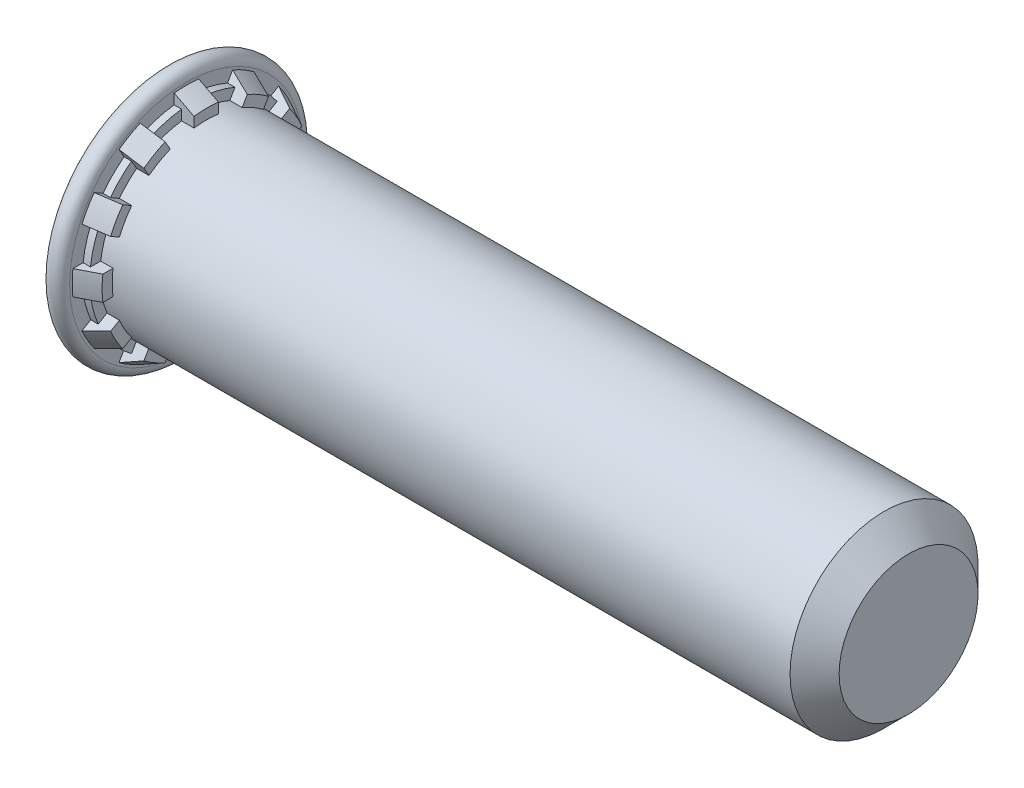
from build123d import *

# Parameters (mm, degrees)
RIBCUT1_DEPTH    = 0.3175
RIBCUT2_DEPTH    = 0.508
RIBCUTSPAT_COUNT = 12
RIBCUTSPAT_ANGLE = 330


with BuildPart() as part:
    # BodySke → BaseBody (revolve)
    with BuildSketch(Plane.XY, mode=Mode.PRIVATE) as basebody_sk:
        with BuildLine():
            Line((0, 0), (0, 2.99466))
            Line((0, 2.99466), (0.00508, 2.99466))
            Line((0.00508, 2.99466), (0.00508, 2.99974))
            ThreePointArc((0.00508, 2.99974), (0.25654, 3.2512), (0.508, 2.99974))
            Line((0.508, 2.99974), (0.508, 2.9337))
            Line((0.508, 2.9337), (1.016, 2.67335))
            Line((1.016, 2.67335), (1.016, 2.413))
            Line((1.016, 2.413), (18.42008, 2.413))
            Line((18.42008, 2.413), (19.05, 1.78308))
            Line((19.05, 1.78308), (19.05, 0))
            Line((19.05, 0), (0, 0))
        make_face()
    revolve(basebody_sk.sketch.rotate(Axis((0, 0, 0), (1, 0, 0)), 90), axis=Axis((0, 0, 0), (1, 0, 0)))

    # RibCut1Ske → RibCut1 (cut)
    with BuildSketch(Plane(origin=(1.016, 0, 0), x_dir=(0, 0, -1), z_dir=(1, 0, 0))):
        with BuildLine():
            Line((0.314959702, 2.39235645), (0.314959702, 3.235908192))
            ThreePointArc((0.314959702, 3.235908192), (0.841472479, 3.140418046), (1.345190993, 2.959858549))
            Line((1.345190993, 2.959858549), (0.923415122, 2.229321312))
            ThreePointArc((0.923415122, 2.229321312), (0.624530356, 2.330779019), (0.314959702, 2.39235645))
        make_face()
    ribcut1 = extrude(amount=-RIBCUT1_DEPTH, mode=Mode.SUBTRACT)

    # RibCut2Ske → RibCut2 (cut)
    with BuildSketch(Plane(origin=(1.016, 0, 0), x_dir=(0, 0, -1), z_dir=(1, 0, 0))):
        with BuildLine():
            Line((0.314959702, 2.65473174), (0.314959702, 3.235908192))
            ThreePointArc((0.314959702, 3.235908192), (0.841472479, 3.140418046), (1.345190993, 2.959858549))
            Line((1.345190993, 2.959858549), (1.054602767, 2.456544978))
            ThreePointArc((1.054602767, 2.456544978), (0.691913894, 2.582257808), (0.314959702, 2.65473174))
        make_face()
    ribcut2 = extrude(amount=-RIBCUT2_DEPTH, mode=Mode.SUBTRACT)

    # RibCutsPat: RibCut1, RibCut2 ×12 about axis
    ribcutspat_axis = Axis((0, 0, 0), (1, 0, 0))
    add([ribcut1.rotate(ribcutspat_axis, i * RIBCUTSPAT_ANGLE / (RIBCUTSPAT_COUNT - 1)) for i in range(1, RIBCUTSPAT_COUNT)], mode=Mode.SUBTRACT)
    add([ribcut2.rotate(ribcutspat_axis, i * RIBCUTSPAT_ANGLE / (RIBCUTSPAT_COUNT - 1)) for i in range(1, RIBCUTSPAT_COUNT)], mode=Mode.SUBTRACT)


solid = part.part
